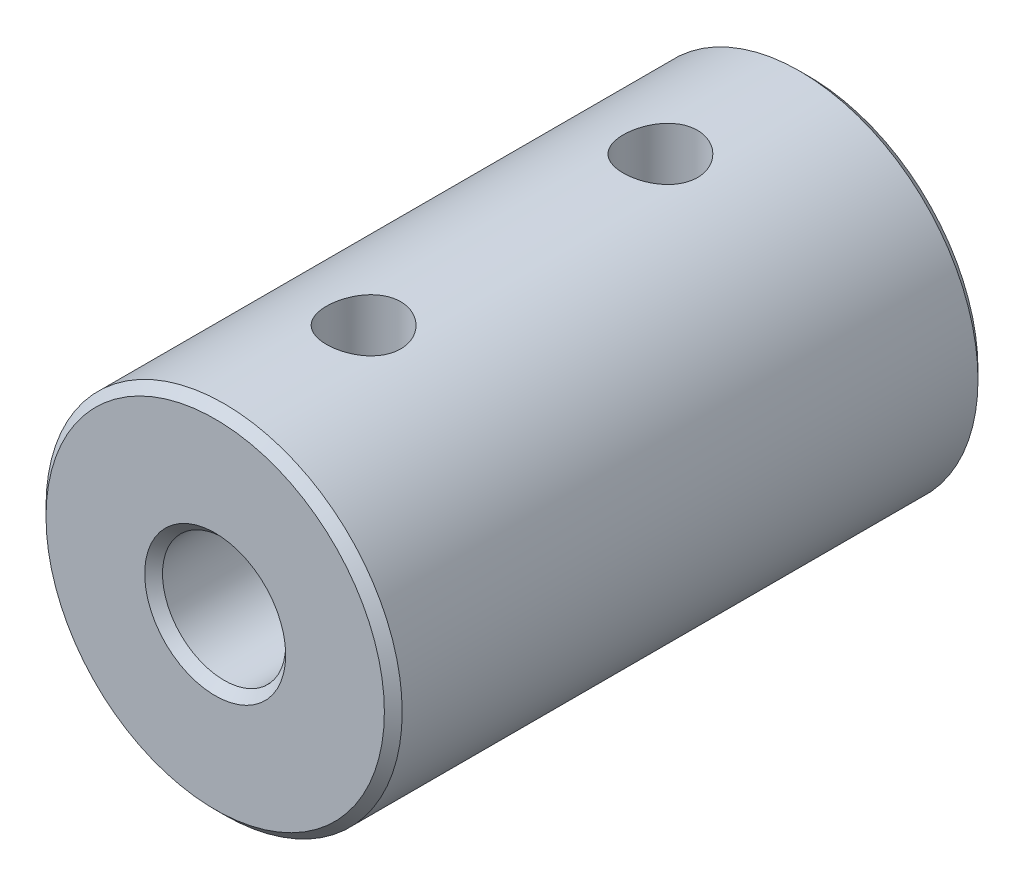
from build123d import *

# Parameters (mm, degrees)
ESQUISSE1_R             = 6
ESQUISSE1_R_2           = 1.575
BOSS_EXTRU_1_DEPTH      = 10
ESQUISSE2_R             = 2.075
ENL_V_MAT_EXTRU_1_DEPTH = 10
ESQUISSE3_R             = 1.25
ENL_V_MAT_EXTRU_2_DEPTH = 6
CHANFREIN1_SIZE         = 0.3


with BuildPart() as part:
    # Esquisse1 → Boss.-Extru.1 (new, symmetric)
    with BuildSketch(Plane.XY):
        Circle(ESQUISSE1_R)
        Circle(ESQUISSE1_R_2, mode=Mode.SUBTRACT)
    extrude(amount=BOSS_EXTRU_1_DEPTH, both=True)

    # Esquisse2 → Enl_v. mat.-Extru.1 (cut)
    with BuildSketch(Plane.XY.offset(10)):
        Circle(ESQUISSE2_R)
    extrude(amount=-ENL_V_MAT_EXTRU_1_DEPTH, mode=Mode.SUBTRACT)

    # Esquisse3 → Enl_v. mat.-Extru.2 (cut, symmetric)
    with BuildSketch(Plane(origin=(0, 0, 0), x_dir=(-1, 0, 0), z_dir=(0, 1, 0))):
        with Locations(Location((0, 5, 0), (0, 0, 90))):
            Circle(ESQUISSE3_R)
        with Locations(Location((0, -5, 0), (0, 0, 90))):
            Circle(ESQUISSE3_R)
    extrude(amount=ENL_V_MAT_EXTRU_2_DEPTH, both=True, mode=Mode.SUBTRACT)

    # Chanfrein1
    chanfrein1_edges = [part.edges().sort_by_distance(p)[0] for p in [
        (-2.075, 0, 10),
        (-6, 0, -10),
        (-6, 0, 10),
        (-1.575, 0, -10),
    ]]
    chamfer(chanfrein1_edges, length=CHANFREIN1_SIZE)


solid = part.part
